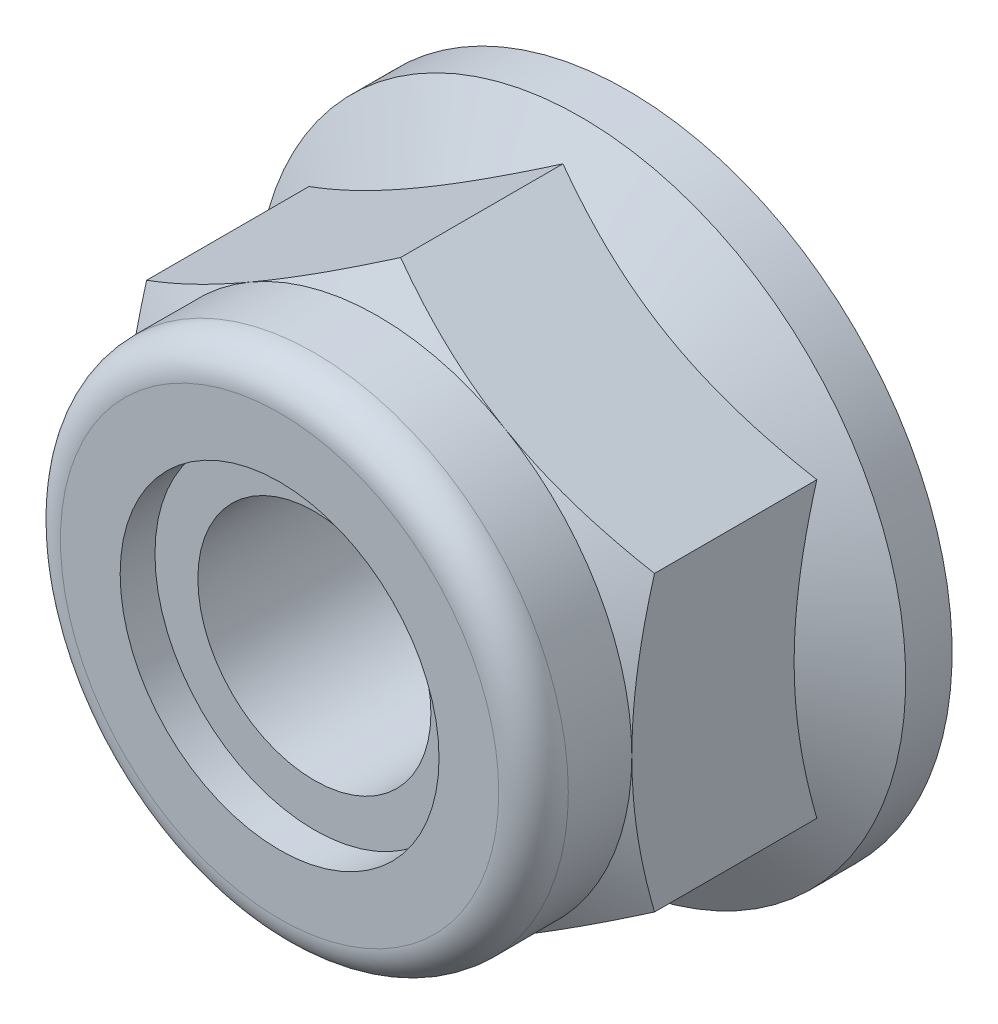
ISO-10303-21;
HEADER;
FILE_DESCRIPTION(('STEP AP214'),'2;1');
FILE_NAME('part.step','',(''),(''),'','','');
FILE_SCHEMA(('AUTOMOTIVE_DESIGN { 1 0 10303 214 1 1 1 1 }'));
ENDSEC;
DATA;
#1=APPLICATION_CONTEXT('core data for automotive mechanical design processes');
#2=APPLICATION_PROTOCOL_DEFINITION('international standard','automotive_design',2000,#1);
#3=PRODUCT_CONTEXT('',#1,'mechanical');
#4=PRODUCT('Part','Part','',(#3));
#5=PRODUCT_RELATED_PRODUCT_CATEGORY('part','',(#4));
#6=PRODUCT_DEFINITION_FORMATION('','',#4);
#7=PRODUCT_DEFINITION_CONTEXT('part definition',#1,'design');
#8=PRODUCT_DEFINITION('design','',#6,#7);
#9=PRODUCT_DEFINITION_SHAPE('','',#8);
#10=(LENGTH_UNIT() NAMED_UNIT(*) SI_UNIT(.MILLI.,.METRE.));
#11=(NAMED_UNIT(*) PLANE_ANGLE_UNIT() SI_UNIT($,.RADIAN.));
#12=(NAMED_UNIT(*) SI_UNIT($,.STERADIAN.) SOLID_ANGLE_UNIT());
#13=UNCERTAINTY_MEASURE_WITH_UNIT(LENGTH_MEASURE(1.E-05),#10,'distance_accuracy_value','');
#14=(GEOMETRIC_REPRESENTATION_CONTEXT(3) GLOBAL_UNCERTAINTY_ASSIGNED_CONTEXT((#13)) GLOBAL_UNIT_ASSIGNED_CONTEXT((#10,
#11,#12)) REPRESENTATION_CONTEXT('',''));
#15=CARTESIAN_POINT('',(0.,0.,0.));
#16=DIRECTION('',(0.,0.,1.));
#17=DIRECTION('',(1.,0.,0.));
#18=AXIS2_PLACEMENT_3D('',#15,#16,#17);
#19=CARTESIAN_POINT('',(0.,-6.42313721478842,22.4605702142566));
#20=DIRECTION('',(-0.5,0.866025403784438,0.));
#21=DIRECTION('',(-0.866025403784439,-0.5,0.));
#22=AXIS2_PLACEMENT_3D('',#19,#20,#21);
#23=PLANE('',#22);
#24=CARTESIAN_POINT('',(-0.000199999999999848,-6.42325268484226,4.96964844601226));
#25=CARTESIAN_POINT('',(0.122072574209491,-6.3526585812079,5.01040030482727));
#26=CARTESIAN_POINT('',(0.244801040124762,-6.28180126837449,5.04930273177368));
#27=CARTESIAN_POINT('',(0.491254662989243,-6.13951120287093,5.12289934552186));
#28=CARTESIAN_POINT('',(0.614980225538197,-6.06807821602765,5.15759171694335));
#29=CARTESIAN_POINT('',(0.988137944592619,-5.85263550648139,5.25467280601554));
#30=CARTESIAN_POINT('',(1.23904309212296,-5.70777535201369,5.30989166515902));
#31=CARTESIAN_POINT('',(1.61451808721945,-5.49099476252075,5.37464272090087));
#32=CARTESIAN_POINT('',(1.73796603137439,-5.41972205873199,5.39308850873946));
#33=CARTESIAN_POINT('',(1.98541973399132,-5.27685459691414,5.42401961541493));
#34=CARTESIAN_POINT('',(2.10942544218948,-5.20525986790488,5.43650546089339));
#35=CARTESIAN_POINT('',(2.35765224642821,-5.06194605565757,5.45519847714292));
#36=CARTESIAN_POINT('',(2.48187293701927,-4.9902272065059,5.46141277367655));
#37=CARTESIAN_POINT('',(2.73042222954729,-4.84672720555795,5.46743610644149));
#38=CARTESIAN_POINT('',(2.85475082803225,-4.7749460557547,5.46724534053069));
#39=CARTESIAN_POINT('',(3.19537539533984,-4.57828637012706,5.45791840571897));
#40=CARTESIAN_POINT('',(3.41155987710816,-4.4534722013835,5.44225911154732));
#41=CARTESIAN_POINT('',(3.84249295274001,-4.20467287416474,5.39260218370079));
#42=CARTESIAN_POINT('',(4.05724003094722,-4.08068859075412,5.35858757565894));
#43=CARTESIAN_POINT('',(4.4890404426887,-3.83138850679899,5.27356046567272));
#44=CARTESIAN_POINT('',(4.70603928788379,-3.70610416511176,5.22218769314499));
#45=CARTESIAN_POINT('',(5.13680081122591,-3.45740388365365,5.1055920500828));
#46=CARTESIAN_POINT('',(5.35056900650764,-3.33398475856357,5.04039656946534));
#47=CARTESIAN_POINT('',(5.5628,-3.21145313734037,4.96964844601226));
#48=B_SPLINE_CURVE_WITH_KNOTS('',3,(#24,#25,#26,#27,#28,#29,#30,#31,#32,#33,#34,#35,#36,#37,#38,
#39,#40,#41,#42,#43,#44,#45,#46,#47),.UNSPECIFIED.,.F.,.F.,(4,2,2,2,2,2,2,2,2,2,2,4),(0.,
0.440820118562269,0.881829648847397,1.76568130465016,2.19678242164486,2.62784543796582,
3.05841812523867,3.48897751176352,4.23854798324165,4.98881282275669,5.75571809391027,
6.52111769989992),.UNSPECIFIED.);
#49=CARTESIAN_POINT('',(0.,-6.42313721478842,4.96971511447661));
#50=VERTEX_POINT('',#49);
#51=CARTESIAN_POINT('',(2.78130000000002,-4.81735291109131,5.46654650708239));
#52=VERTEX_POINT('',#51);
#53=EDGE_CURVE('E294',#50,#52,#48,.T.);
#54=ORIENTED_EDGE('',*,*,#53,.F.);
#55=DIRECTION('',(0.,0.,-1.));
#56=VECTOR('',#55,1.);
#57=CARTESIAN_POINT('',(0.,-6.42313721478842,22.4605702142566));
#58=LINE('',#57,#56);
#59=CARTESIAN_POINT('',(0.,-6.42313721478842,1.41371511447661));
#60=VERTEX_POINT('',#59);
#61=EDGE_CURVE('E136',#50,#60,#58,.T.);
#62=ORIENTED_EDGE('',*,*,#61,.T.);
#63=CARTESIAN_POINT('',(-0.000199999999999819,-6.42325268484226,1.41364844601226));
#64=CARTESIAN_POINT('',(0.122072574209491,-6.3526585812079,1.45440030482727));
#65=CARTESIAN_POINT('',(0.244801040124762,-6.28180126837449,1.49330273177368));
#66=CARTESIAN_POINT('',(0.491254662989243,-6.13951120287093,1.56689934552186));
#67=CARTESIAN_POINT('',(0.614980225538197,-6.06807821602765,1.60159171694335));
#68=CARTESIAN_POINT('',(0.988137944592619,-5.85263550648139,1.69867280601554));
#69=CARTESIAN_POINT('',(1.23904309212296,-5.70777535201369,1.75389166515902));
#70=CARTESIAN_POINT('',(1.61451808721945,-5.49099476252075,1.81864272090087));
#71=CARTESIAN_POINT('',(1.73796603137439,-5.41972205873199,1.83708850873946));
#72=CARTESIAN_POINT('',(1.98541973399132,-5.27685459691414,1.86801961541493));
#73=CARTESIAN_POINT('',(2.10942544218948,-5.20525986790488,1.88050546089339));
#74=CARTESIAN_POINT('',(2.35765224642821,-5.06194605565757,1.89919847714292));
#75=CARTESIAN_POINT('',(2.48187293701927,-4.9902272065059,1.90541277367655));
#76=CARTESIAN_POINT('',(2.7304222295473,-4.84672720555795,1.91143610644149));
#77=CARTESIAN_POINT('',(2.85475082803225,-4.7749460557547,1.91124534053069));
#78=CARTESIAN_POINT('',(3.19537539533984,-4.57828637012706,1.90191840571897));
#79=CARTESIAN_POINT('',(3.41155987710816,-4.4534722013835,1.88625911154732));
#80=CARTESIAN_POINT('',(3.84249295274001,-4.20467287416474,1.83660218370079));
#81=CARTESIAN_POINT('',(4.05724003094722,-4.08068859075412,1.80258757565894));
#82=CARTESIAN_POINT('',(4.48904044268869,-3.83138850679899,1.71756046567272));
#83=CARTESIAN_POINT('',(4.70603928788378,-3.70610416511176,1.66618769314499));
#84=CARTESIAN_POINT('',(5.13680081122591,-3.45740388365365,1.5495920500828));
#85=CARTESIAN_POINT('',(5.35056900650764,-3.33398475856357,1.48439656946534));
#86=CARTESIAN_POINT('',(5.5628,-3.21145313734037,1.41364844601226));
#87=B_SPLINE_CURVE_WITH_KNOTS('',3,(#63,#64,#65,#66,#67,#68,#69,#70,#71,#72,#73,#74,#75,#76,#77,
#78,#79,#80,#81,#82,#83,#84,#85,#86),.UNSPECIFIED.,.F.,.F.,(4,2,2,2,2,2,2,2,2,2,2,4),(0.,
0.440820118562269,0.881829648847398,1.76568130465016,2.19678242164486,2.62784543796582,
3.05841812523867,3.48897751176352,4.23854798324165,4.98881282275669,5.75571809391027,
6.52111769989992),.UNSPECIFIED.);
#88=CARTESIAN_POINT('',(5.5626,-3.21156860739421,1.41371511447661));
#89=VERTEX_POINT('',#88);
#90=EDGE_CURVE('E264',#60,#89,#87,.T.);
#91=ORIENTED_EDGE('',*,*,#90,.T.);
#92=DIRECTION('',(0.,0.,-1.));
#93=VECTOR('',#92,1.);
#94=CARTESIAN_POINT('',(5.5626,-3.21156860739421,22.4605702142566));
#95=LINE('',#94,#93);
#96=CARTESIAN_POINT('',(5.5626,-3.21156860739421,4.96971511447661));
#97=VERTEX_POINT('',#96);
#98=EDGE_CURVE('E302',#97,#89,#95,.T.);
#99=ORIENTED_EDGE('',*,*,#98,.F.);
#100=EDGE_CURVE('E130',#52,#97,#48,.T.);
#101=ORIENTED_EDGE('',*,*,#100,.F.);
#102=EDGE_LOOP('',(#54,#62,#91,#99,#101));
#103=FACE_BOUND('',#102,.T.);
#104=ADVANCED_FACE('F50',(#103),#23,.F.);
#105=CARTESIAN_POINT('',(5.5626,-3.21156860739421,22.4605702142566));
#106=DIRECTION('',(-1.,0.,0.));
#107=DIRECTION('',(0.,0.,1.));
#108=AXIS2_PLACEMENT_3D('',#105,#106,#107);
#109=PLANE('',#108);
#110=CARTESIAN_POINT('',(5.5626,-8.51755323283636,2.80469385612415));
#111=CARTESIAN_POINT('',(5.5626,-8.27332363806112,2.92271908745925));
#112=CARTESIAN_POINT('',(5.5626,-8.02851660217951,3.0395710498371));
#113=CARTESIAN_POINT('',(5.5626,-7.53743543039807,3.27025799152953));
#114=CARTESIAN_POINT('',(5.5626,-7.29116104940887,3.38409244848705));
#115=CARTESIAN_POINT('',(5.5626,-6.79550261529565,3.60867362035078));
#116=CARTESIAN_POINT('',(5.5626,-6.54610883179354,3.71939893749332));
#117=CARTESIAN_POINT('',(5.5626,-6.04527145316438,3.93609364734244));
#118=CARTESIAN_POINT('',(5.5626,-5.79382796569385,4.04206328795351));
#119=CARTESIAN_POINT('',(5.5626,-5.28536985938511,4.24924012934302));
#120=CARTESIAN_POINT('',(5.5626,-5.02832474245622,4.35037289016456));
#121=CARTESIAN_POINT('',(5.5626,-4.51120244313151,4.54471766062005));
#122=CARTESIAN_POINT('',(5.5626,-4.25112492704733,4.63792878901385));
#123=CARTESIAN_POINT('',(5.5626,-3.72805915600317,4.81392599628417));
#124=CARTESIAN_POINT('',(5.5626,-3.46507843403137,4.89673423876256));
#125=CARTESIAN_POINT('',(5.5626,-2.9353756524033,5.04923536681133));
#126=CARTESIAN_POINT('',(5.5626,-2.66865480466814,5.11893239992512));
#127=CARTESIAN_POINT('',(5.5626,-2.13130244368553,5.24183109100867));
#128=CARTESIAN_POINT('',(5.5626,-1.86066990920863,5.29502835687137));
#129=CARTESIAN_POINT('',(5.5626,-1.31610403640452,5.38133241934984));
#130=CARTESIAN_POINT('',(5.5626,-1.04217069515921,5.41443919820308));
#131=CARTESIAN_POINT('',(5.5626,-0.63083475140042,5.44690919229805));
#132=CARTESIAN_POINT('',(5.5626,-0.494076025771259,5.45486914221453));
#133=CARTESIAN_POINT('',(5.5626,-0.220337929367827,5.46499403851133));
#134=CARTESIAN_POINT('',(5.5626,-0.0833585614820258,5.46715906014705));
#135=CARTESIAN_POINT('',(5.5626,0.190527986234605,5.46563594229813));
#136=CARTESIAN_POINT('',(5.5626,0.327435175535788,5.46194944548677));
#137=CARTESIAN_POINT('',(5.5626,0.600975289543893,5.44881671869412));
#138=CARTESIAN_POINT('',(5.5626,0.737608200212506,5.43937020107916));
#139=CARTESIAN_POINT('',(5.5626,1.06876418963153,5.40969085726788));
#140=CARTESIAN_POINT('',(5.5626,1.26303278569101,5.38657182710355));
#141=CARTESIAN_POINT('',(5.5626,1.6500813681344,5.32997193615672));
#142=CARTESIAN_POINT('',(5.5626,1.84286093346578,5.29648824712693));
#143=CARTESIAN_POINT('',(5.5626,2.22677234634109,5.22034654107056));
#144=CARTESIAN_POINT('',(5.5626,2.41790245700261,5.17767984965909));
#145=CARTESIAN_POINT('',(5.5626,2.7981962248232,5.08447396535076));
#146=CARTESIAN_POINT('',(5.5626,2.98736006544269,5.0339355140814));
#147=CARTESIAN_POINT('',(5.5626,3.36838035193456,4.92487411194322));
#148=CARTESIAN_POINT('',(5.5626,3.56018914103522,4.86618580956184));
#149=CARTESIAN_POINT('',(5.5626,3.94177929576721,4.74301046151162));
#150=CARTESIAN_POINT('',(5.5626,4.13156196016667,4.67852741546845));
#151=CARTESIAN_POINT('',(5.5626,4.5083383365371,4.54509454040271));
#152=CARTESIAN_POINT('',(5.5626,4.69534173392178,4.47617189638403));
#153=CARTESIAN_POINT('',(5.5626,5.06789764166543,4.33428124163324));
#154=CARTESIAN_POINT('',(5.5626,5.25344953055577,4.26131159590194));
#155=CARTESIAN_POINT('',(5.5626,5.43832732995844,4.18671878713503));
#156=B_SPLINE_CURVE_WITH_KNOTS('',3,(#110,#111,#112,#113,#114,#115,#116,#117,#118,#119,#120,
#121,#122,#123,#124,#125,#126,#127,#128,#129,#130,#131,#132,#133,#134,#135,#136,#137,#138,#139,
#140,#141,#142,#143,#144,#145,#146,#147,#148,#149,#150,#151,#152,#153,#154,#155),.UNSPECIFIED.,
.F.,.F.,(4,2,2,2,2,2,2,2,2,2,2,2,2,2,2,2,2,2,2,2,2,2,4),(0.,0.813769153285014,1.62767826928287,
2.44624505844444,3.26476912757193,4.09334213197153,4.92200719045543,5.74887568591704,
6.57548217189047,7.40230850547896,8.22913557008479,8.64000180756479,9.0508627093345,
9.46160829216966,9.87237438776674,10.4589658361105,11.0457174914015,11.633025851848,
12.2202789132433,12.8219268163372,13.4231625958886,14.021014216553,14.6191091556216),.UNSPECIFIED.);
#157=CARTESIAN_POINT('',(5.5626,0.,5.46654650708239));
#158=VERTEX_POINT('',#157);
#159=EDGE_CURVE('E122',#97,#158,#156,.T.);
#160=ORIENTED_EDGE('',*,*,#159,.F.);
#161=ORIENTED_EDGE('',*,*,#98,.T.);
#162=CARTESIAN_POINT('',(5.5626,-8.57284095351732,-0.778057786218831));
#163=CARTESIAN_POINT('',(5.5626,-8.33033463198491,-0.660637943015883));
#164=CARTESIAN_POINT('',(5.5626,-8.08726580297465,-0.544359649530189));
#165=CARTESIAN_POINT('',(5.5626,-7.59970378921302,-0.31472929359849));
#166=CARTESIAN_POINT('',(5.5626,-7.35521038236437,-0.201377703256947));
#167=CARTESIAN_POINT('',(5.5626,-6.86321410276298,0.0223379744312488));
#168=CARTESIAN_POINT('',(5.5626,-6.61570205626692,0.132681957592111));
#169=CARTESIAN_POINT('',(5.5626,-6.11869041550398,0.348781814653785));
#170=CARTESIAN_POINT('',(5.5626,-5.8691909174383,0.454537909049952));
#171=CARTESIAN_POINT('',(5.5626,-5.35995883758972,0.663469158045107));
#172=CARTESIAN_POINT('',(5.5626,-5.10015026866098,0.766460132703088));
#173=CARTESIAN_POINT('',(5.5626,-4.57747364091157,0.964516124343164));
#174=CARTESIAN_POINT('',(5.5626,-4.31460523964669,1.05958024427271));
#175=CARTESIAN_POINT('',(5.5626,-3.78590054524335,1.23924735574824));
#176=CARTESIAN_POINT('',(5.5626,-3.52007168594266,1.32387200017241));
#177=CARTESIAN_POINT('',(5.5626,-2.98460145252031,1.47990914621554));
#178=CARTESIAN_POINT('',(5.5626,-2.71496132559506,1.55132586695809));
#179=CARTESIAN_POINT('',(5.5626,-2.17320501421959,1.67710689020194));
#180=CARTESIAN_POINT('',(5.5626,-1.90111026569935,1.73156180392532));
#181=CARTESIAN_POINT('',(5.5626,-1.3535941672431,1.8203052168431));
#182=CARTESIAN_POINT('',(5.5626,-1.07817311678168,1.85459551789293));
#183=CARTESIAN_POINT('',(5.5626,-0.528954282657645,1.89982426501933));
#184=CARTESIAN_POINT('',(5.5626,-0.255181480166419,1.91105860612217));
#185=CARTESIAN_POINT('',(5.5626,0.292338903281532,1.90999858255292));
#186=CARTESIAN_POINT('',(5.5626,0.566086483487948,1.8977036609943));
#187=CARTESIAN_POINT('',(5.5626,1.03244886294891,1.85757660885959));
#188=CARTESIAN_POINT('',(5.5626,1.22556804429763,1.83528484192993));
#189=CARTESIAN_POINT('',(5.5626,1.61034862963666,1.78040863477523));
#190=CARTESIAN_POINT('',(5.5626,1.80200982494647,1.74782274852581));
#191=CARTESIAN_POINT('',(5.5626,2.37457656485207,1.63634135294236));
#192=CARTESIAN_POINT('',(5.5626,2.75284162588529,1.54374386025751));
#193=CARTESIAN_POINT('',(5.5626,3.3183672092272,1.38374284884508));
#194=CARTESIAN_POINT('',(5.5626,3.50857351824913,1.32616305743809));
#195=CARTESIAN_POINT('',(5.5626,3.8871375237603,1.20516419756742));
#196=CARTESIAN_POINT('',(5.5626,4.07549520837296,1.14174509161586));
#197=CARTESIAN_POINT('',(5.5626,4.45042430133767,1.01007349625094));
#198=CARTESIAN_POINT('',(5.5626,4.63699630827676,0.941822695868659));
#199=CARTESIAN_POINT('',(5.5626,5.00860424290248,0.801276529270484));
#200=CARTESIAN_POINT('',(5.5626,5.19364018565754,0.728981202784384));
#201=CARTESIAN_POINT('',(5.5626,5.6178263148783,0.558756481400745));
#202=CARTESIAN_POINT('',(5.5626,5.85650688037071,0.459659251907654));
#203=CARTESIAN_POINT('',(5.5626,6.33193644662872,0.256923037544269));
#204=CARTESIAN_POINT('',(5.5626,6.5686853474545,0.153283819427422));
#205=CARTESIAN_POINT('',(5.5626,7.04059162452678,-0.0576576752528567));
#206=CARTESIAN_POINT('',(5.5626,7.27574871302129,-0.164960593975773));
#207=CARTESIAN_POINT('',(5.5626,7.74469027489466,-0.38252918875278));
#208=CARTESIAN_POINT('',(5.5626,7.97847472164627,-0.492794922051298));
#209=CARTESIAN_POINT('',(5.5626,8.67851780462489,-0.827402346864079));
#210=CARTESIAN_POINT('',(5.5626,9.14304538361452,-1.05536370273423));
#211=CARTESIAN_POINT('',(5.5626,10.068793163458,-1.51790472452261));
#212=CARTESIAN_POINT('',(5.5626,10.530013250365,-1.75248461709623));
#213=CARTESIAN_POINT('',(5.5626,11.2017197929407,-2.09850330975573));
#214=CARTESIAN_POINT('',(5.5626,11.413174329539,-2.20806832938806));
#215=CARTESIAN_POINT('',(5.5626,11.8356219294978,-2.42807556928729));
#216=CARTESIAN_POINT('',(5.5626,12.0466150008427,-2.53851777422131));
#217=CARTESIAN_POINT('',(5.5626,12.6790097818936,-2.87099441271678));
#218=CARTESIAN_POINT('',(5.5626,13.0998112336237,-3.09417069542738));
#219=CARTESIAN_POINT('',(5.5626,13.9392069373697,-3.54234332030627));
#220=CARTESIAN_POINT('',(5.5626,14.3578040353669,-3.76733434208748));
#221=CARTESIAN_POINT('',(5.5626,15.1939759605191,-4.21915836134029));
#222=CARTESIAN_POINT('',(5.5626,15.6115508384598,-4.44599126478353));
#223=CARTESIAN_POINT('',(5.5626,16.0287456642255,-4.673516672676));
#224=B_SPLINE_CURVE_WITH_KNOTS('',3,(#162,#163,#164,#165,#166,#167,#168,#169,#170,#171,#172,
#173,#174,#175,#176,#177,#178,#179,#180,#181,#182,#183,#184,#185,#186,#187,#188,#189,#190,#191,
#192,#193,#194,#195,#196,#197,#198,#199,#200,#201,#202,#203,#204,#205,#206,#207,#208,#209,#210,
#211,#212,#213,#214,#215,#216,#217,#218,#219,#220,#221,#222,#223),.UNSPECIFIED.,.F.,.F.,(4,2,2,
2,2,2,2,2,2,2,2,2,2,2,2,2,2,2,2,2,2,2,2,2,2,2,2,2,2,2,4),(0.,0.808323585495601,1.61677675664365,
2.42972294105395,3.24263001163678,4.08096236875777,4.91938946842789,5.75604722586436,
6.59243725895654,7.42427940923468,8.25604721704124,9.07707180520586,9.89811582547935,
10.4810364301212,11.0640389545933,12.2307150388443,12.8268583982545,13.4230055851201,
14.0189453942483,14.6148793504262,15.390122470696,16.1654054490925,16.9408250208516,
17.7162595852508,19.268514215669,20.8208220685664,21.5352835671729,22.2497326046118,
23.6786841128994,25.1043723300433,26.5299882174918),.UNSPECIFIED.);
#225=CARTESIAN_POINT('',(5.5626,3.21156860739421,1.41371511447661));
#226=VERTEX_POINT('',#225);
#227=EDGE_CURVE('E257',#89,#226,#224,.T.);
#228=ORIENTED_EDGE('',*,*,#227,.T.);
#229=DIRECTION('',(0.,0.,-1.));
#230=VECTOR('',#229,1.);
#231=CARTESIAN_POINT('',(5.5626,3.21156860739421,22.4605702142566));
#232=LINE('',#231,#230);
#233=CARTESIAN_POINT('',(5.5626,3.21156860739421,4.96971511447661));
#234=VERTEX_POINT('',#233);
#235=EDGE_CURVE('E146',#234,#226,#232,.T.);
#236=ORIENTED_EDGE('',*,*,#235,.F.);
#237=EDGE_CURVE('E131',#158,#234,#156,.T.);
#238=ORIENTED_EDGE('',*,*,#237,.F.);
#239=EDGE_LOOP('',(#160,#161,#228,#236,#238));
#240=FACE_BOUND('',#239,.T.);
#241=ADVANCED_FACE('F148',(#240),#109,.F.);
#242=CARTESIAN_POINT('',(5.5626,3.21156860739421,22.4605702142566));
#243=DIRECTION('',(-0.5,-0.866025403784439,0.));
#244=DIRECTION('',(0.866025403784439,-0.5,0.));
#245=AXIS2_PLACEMENT_3D('',#242,#243,#244);
#246=PLANE('',#245);
#247=CARTESIAN_POINT('',(5.5628,3.21145313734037,4.96964844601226));
#248=CARTESIAN_POINT('',(5.44052742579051,3.28204724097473,5.01040030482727));
#249=CARTESIAN_POINT('',(5.31779895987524,3.35290455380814,5.04930273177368));
#250=CARTESIAN_POINT('',(5.07134533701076,3.49519461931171,5.12289934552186));
#251=CARTESIAN_POINT('',(4.9476197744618,3.56662760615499,5.15759171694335));
#252=CARTESIAN_POINT('',(4.57446205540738,3.78207031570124,5.25467280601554));
#253=CARTESIAN_POINT('',(4.32355690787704,3.92693047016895,5.30989166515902));
#254=CARTESIAN_POINT('',(3.94808191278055,4.14371105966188,5.37464272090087));
#255=CARTESIAN_POINT('',(3.82463396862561,4.21498376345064,5.39308850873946));
#256=CARTESIAN_POINT('',(3.57718026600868,4.35785122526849,5.42401961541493));
#257=CARTESIAN_POINT('',(3.45317455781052,4.42944595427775,5.43650546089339));
#258=CARTESIAN_POINT('',(3.20494775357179,4.57275976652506,5.45519847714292));
#259=CARTESIAN_POINT('',(3.08072706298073,4.64447861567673,5.46141277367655));
#260=CARTESIAN_POINT('',(2.8321777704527,4.78797861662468,5.46743610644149));
#261=CARTESIAN_POINT('',(2.70784917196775,4.85975976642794,5.46724534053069));
#262=CARTESIAN_POINT('',(2.36722460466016,5.05641945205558,5.45791840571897));
#263=CARTESIAN_POINT('',(2.15104012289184,5.18123362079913,5.44225911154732));
#264=CARTESIAN_POINT('',(1.72010704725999,5.4300329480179,5.39260218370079));
#265=CARTESIAN_POINT('',(1.50535996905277,5.55401723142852,5.35858757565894));
#266=CARTESIAN_POINT('',(1.0735595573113,5.80331731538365,5.27356046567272));
#267=CARTESIAN_POINT('',(0.856560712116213,5.92860165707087,5.22218769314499));
#268=CARTESIAN_POINT('',(0.425799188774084,6.17730193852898,5.1055920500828));
#269=CARTESIAN_POINT('',(0.212030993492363,6.30072106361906,5.04039656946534));
#270=CARTESIAN_POINT('',(-0.000200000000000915,6.42325268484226,4.96964844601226));
#271=B_SPLINE_CURVE_WITH_KNOTS('',3,(#247,#248,#249,#250,#251,#252,#253,#254,#255,#256,#257,
#258,#259,#260,#261,#262,#263,#264,#265,#266,#267,#268,#269,#270),.UNSPECIFIED.,.F.,.F.,(4,2,2,
2,2,2,2,2,2,2,2,4),(0.,0.440820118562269,0.881829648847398,1.76568130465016,2.19678242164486,
2.62784543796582,3.05841812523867,3.48897751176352,4.23854798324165,4.98881282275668,
5.75571809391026,6.52111769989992),.UNSPECIFIED.);
#272=CARTESIAN_POINT('',(2.78130000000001,4.81735291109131,5.46654650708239));
#273=VERTEX_POINT('',#272);
#274=EDGE_CURVE('E139',#234,#273,#271,.T.);
#275=ORIENTED_EDGE('',*,*,#274,.F.);
#276=ORIENTED_EDGE('',*,*,#235,.T.);
#277=CARTESIAN_POINT('',(5.5628,3.21145313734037,1.41364844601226));
#278=CARTESIAN_POINT('',(5.44052742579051,3.28204724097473,1.45440030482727));
#279=CARTESIAN_POINT('',(5.31779895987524,3.35290455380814,1.49330273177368));
#280=CARTESIAN_POINT('',(5.07134533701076,3.49519461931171,1.56689934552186));
#281=CARTESIAN_POINT('',(4.9476197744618,3.56662760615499,1.60159171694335));
#282=CARTESIAN_POINT('',(4.57446205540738,3.78207031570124,1.69867280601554));
#283=CARTESIAN_POINT('',(4.32355690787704,3.92693047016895,1.75389166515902));
#284=CARTESIAN_POINT('',(3.94808191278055,4.14371105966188,1.81864272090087));
#285=CARTESIAN_POINT('',(3.82463396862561,4.21498376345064,1.83708850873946));
#286=CARTESIAN_POINT('',(3.57718026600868,4.35785122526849,1.86801961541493));
#287=CARTESIAN_POINT('',(3.45317455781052,4.42944595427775,1.88050546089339));
#288=CARTESIAN_POINT('',(3.20494775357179,4.57275976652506,1.89919847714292));
#289=CARTESIAN_POINT('',(3.08072706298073,4.64447861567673,1.90541277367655));
#290=CARTESIAN_POINT('',(2.8321777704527,4.78797861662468,1.91143610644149));
#291=CARTESIAN_POINT('',(2.70784917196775,4.85975976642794,1.91124534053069));
#292=CARTESIAN_POINT('',(2.36722460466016,5.05641945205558,1.90191840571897));
#293=CARTESIAN_POINT('',(2.15104012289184,5.18123362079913,1.88625911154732));
#294=CARTESIAN_POINT('',(1.72010704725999,5.4300329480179,1.83660218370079));
#295=CARTESIAN_POINT('',(1.50535996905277,5.55401723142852,1.80258757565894));
#296=CARTESIAN_POINT('',(1.0735595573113,5.80331731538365,1.71756046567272));
#297=CARTESIAN_POINT('',(0.856560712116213,5.92860165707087,1.66618769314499));
#298=CARTESIAN_POINT('',(0.425799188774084,6.17730193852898,1.5495920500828));
#299=CARTESIAN_POINT('',(0.212030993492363,6.30072106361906,1.48439656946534));
#300=CARTESIAN_POINT('',(-0.000200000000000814,6.42325268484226,1.41364844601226));
#301=B_SPLINE_CURVE_WITH_KNOTS('',3,(#277,#278,#279,#280,#281,#282,#283,#284,#285,#286,#287,
#288,#289,#290,#291,#292,#293,#294,#295,#296,#297,#298,#299,#300),.UNSPECIFIED.,.F.,.F.,(4,2,2,
2,2,2,2,2,2,2,2,4),(0.,0.440820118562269,0.881829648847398,1.76568130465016,2.19678242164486,
2.62784543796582,3.05841812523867,3.48897751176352,4.23854798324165,4.98881282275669,
5.75571809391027,6.52111769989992),.UNSPECIFIED.);
#302=CARTESIAN_POINT('',(0.,6.42313721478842,1.41371511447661));
#303=VERTEX_POINT('',#302);
#304=EDGE_CURVE('E226',#226,#303,#301,.T.);
#305=ORIENTED_EDGE('',*,*,#304,.T.);
#306=DIRECTION('',(0.,0.,-1.));
#307=VECTOR('',#306,1.);
#308=CARTESIAN_POINT('',(0.,6.42313721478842,22.4605702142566));
#309=LINE('',#308,#307);
#310=CARTESIAN_POINT('',(0.,6.42313721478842,4.96971511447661));
#311=VERTEX_POINT('',#310);
#312=EDGE_CURVE('E311',#311,#303,#309,.T.);
#313=ORIENTED_EDGE('',*,*,#312,.F.);
#314=EDGE_CURVE('E149',#273,#311,#271,.T.);
#315=ORIENTED_EDGE('',*,*,#314,.F.);
#316=EDGE_LOOP('',(#275,#276,#305,#313,#315));
#317=FACE_BOUND('',#316,.T.);
#318=ADVANCED_FACE('F211',(#317),#246,.F.);
#319=CARTESIAN_POINT('',(0.,6.42313721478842,22.4605702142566));
#320=DIRECTION('',(0.5,-0.866025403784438,0.));
#321=DIRECTION('',(0.866025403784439,0.5,0.));
#322=AXIS2_PLACEMENT_3D('',#319,#320,#321);
#323=PLANE('',#322);
#324=CARTESIAN_POINT('',(0.000199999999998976,6.42325268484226,4.96964844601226));
#325=CARTESIAN_POINT('',(-0.122072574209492,6.3526585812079,5.01040030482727));
#326=CARTESIAN_POINT('',(-0.244801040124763,6.28180126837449,5.04930273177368));
#327=CARTESIAN_POINT('',(-0.491254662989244,6.13951120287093,5.12289934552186));
#328=CARTESIAN_POINT('',(-0.614980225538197,6.06807821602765,5.15759171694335));
#329=CARTESIAN_POINT('',(-0.988137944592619,5.85263550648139,5.25467280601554));
#330=CARTESIAN_POINT('',(-1.23904309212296,5.70777535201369,5.30989166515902));
#331=CARTESIAN_POINT('',(-1.61451808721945,5.49099476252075,5.37464272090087));
#332=CARTESIAN_POINT('',(-1.73796603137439,5.41972205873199,5.39308850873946));
#333=CARTESIAN_POINT('',(-1.98541973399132,5.27685459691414,5.42401961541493));
#334=CARTESIAN_POINT('',(-2.10942544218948,5.20525986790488,5.43650546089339));
#335=CARTESIAN_POINT('',(-2.35765224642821,5.06194605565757,5.45519847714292));
#336=CARTESIAN_POINT('',(-2.48187293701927,4.9902272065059,5.46141277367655));
#337=CARTESIAN_POINT('',(-2.7304222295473,4.84672720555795,5.46743610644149));
#338=CARTESIAN_POINT('',(-2.85475082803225,4.7749460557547,5.46724534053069));
#339=CARTESIAN_POINT('',(-3.19537539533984,4.57828637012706,5.45791840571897));
#340=CARTESIAN_POINT('',(-3.41155987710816,4.4534722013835,5.44225911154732));
#341=CARTESIAN_POINT('',(-3.84249295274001,4.20467287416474,5.39260218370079));
#342=CARTESIAN_POINT('',(-4.05724003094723,4.08068859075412,5.35858757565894));
#343=CARTESIAN_POINT('',(-4.4890404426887,3.83138850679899,5.27356046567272));
#344=CARTESIAN_POINT('',(-4.70603928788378,3.70610416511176,5.22218769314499));
#345=CARTESIAN_POINT('',(-5.13680081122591,3.45740388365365,5.1055920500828));
#346=CARTESIAN_POINT('',(-5.35056900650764,3.33398475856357,5.04039656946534));
#347=CARTESIAN_POINT('',(-5.5628,3.21145313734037,4.96964844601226));
#348=B_SPLINE_CURVE_WITH_KNOTS('',3,(#324,#325,#326,#327,#328,#329,#330,#331,#332,#333,#334,
#335,#336,#337,#338,#339,#340,#341,#342,#343,#344,#345,#346,#347),.UNSPECIFIED.,.F.,.F.,(4,2,2,
2,2,2,2,2,2,2,2,4),(0.,0.440820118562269,0.881829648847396,1.76568130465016,2.19678242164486,
2.62784543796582,3.05841812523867,3.48897751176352,4.23854798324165,4.98881282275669,
5.75571809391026,6.52111769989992),.UNSPECIFIED.);
#349=CARTESIAN_POINT('',(-2.78129999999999,4.81735291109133,5.46654650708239));
#350=VERTEX_POINT('',#349);
#351=EDGE_CURVE('E210',#311,#350,#348,.T.);
#352=ORIENTED_EDGE('',*,*,#351,.F.);
#353=ORIENTED_EDGE('',*,*,#312,.T.);
#354=CARTESIAN_POINT('',(0.000199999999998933,6.42325268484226,1.41364844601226));
#355=CARTESIAN_POINT('',(-0.122072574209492,6.3526585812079,1.45440030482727));
#356=CARTESIAN_POINT('',(-0.244801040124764,6.28180126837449,1.49330273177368));
#357=CARTESIAN_POINT('',(-0.491254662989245,6.13951120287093,1.56689934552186));
#358=CARTESIAN_POINT('',(-0.614980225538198,6.06807821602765,1.60159171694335));
#359=CARTESIAN_POINT('',(-0.988137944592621,5.85263550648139,1.69867280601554));
#360=CARTESIAN_POINT('',(-1.23904309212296,5.70777535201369,1.75389166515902));
#361=CARTESIAN_POINT('',(-1.61451808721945,5.49099476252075,1.81864272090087));
#362=CARTESIAN_POINT('',(-1.73796603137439,5.41972205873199,1.83708850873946));
#363=CARTESIAN_POINT('',(-1.98541973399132,5.27685459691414,1.86801961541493));
#364=CARTESIAN_POINT('',(-2.10942544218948,5.20525986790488,1.88050546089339));
#365=CARTESIAN_POINT('',(-2.35765224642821,5.06194605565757,1.89919847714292));
#366=CARTESIAN_POINT('',(-2.48187293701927,4.9902272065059,1.90541277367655));
#367=CARTESIAN_POINT('',(-2.7304222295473,4.84672720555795,1.91143610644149));
#368=CARTESIAN_POINT('',(-2.85475082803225,4.7749460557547,1.91124534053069));
#369=CARTESIAN_POINT('',(-3.19537539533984,4.57828637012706,1.90191840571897));
#370=CARTESIAN_POINT('',(-3.41155987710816,4.4534722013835,1.88625911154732));
#371=CARTESIAN_POINT('',(-3.84249295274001,4.20467287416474,1.83660218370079));
#372=CARTESIAN_POINT('',(-4.05724003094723,4.08068859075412,1.80258757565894));
#373=CARTESIAN_POINT('',(-4.4890404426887,3.83138850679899,1.71756046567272));
#374=CARTESIAN_POINT('',(-4.70603928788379,3.70610416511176,1.66618769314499));
#375=CARTESIAN_POINT('',(-5.13680081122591,3.45740388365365,1.5495920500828));
#376=CARTESIAN_POINT('',(-5.35056900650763,3.33398475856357,1.48439656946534));
#377=CARTESIAN_POINT('',(-5.5628,3.21145313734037,1.41364844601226));
#378=B_SPLINE_CURVE_WITH_KNOTS('',3,(#354,#355,#356,#357,#358,#359,#360,#361,#362,#363,#364,
#365,#366,#367,#368,#369,#370,#371,#372,#373,#374,#375,#376,#377),.UNSPECIFIED.,.F.,.F.,(4,2,2,
2,2,2,2,2,2,2,2,4),(0.,0.44082011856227,0.881829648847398,1.76568130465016,2.19678242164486,
2.62784543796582,3.05841812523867,3.48897751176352,4.23854798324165,4.98881282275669,
5.75571809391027,6.52111769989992),.UNSPECIFIED.);
#379=CARTESIAN_POINT('',(-5.5626,3.21156860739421,1.41371511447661));
#380=VERTEX_POINT('',#379);
#381=EDGE_CURVE('E217',#303,#380,#378,.T.);
#382=ORIENTED_EDGE('',*,*,#381,.T.);
#383=DIRECTION('',(0.,0.,-1.));
#384=VECTOR('',#383,1.);
#385=CARTESIAN_POINT('',(-5.5626,3.21156860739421,22.4605702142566));
#386=LINE('',#385,#384);
#387=CARTESIAN_POINT('',(-5.5626,3.21156860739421,4.96971511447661));
#388=VERTEX_POINT('',#387);
#389=EDGE_CURVE('E307',#388,#380,#386,.T.);
#390=ORIENTED_EDGE('',*,*,#389,.F.);
#391=EDGE_CURVE('E203',#350,#388,#348,.T.);
#392=ORIENTED_EDGE('',*,*,#391,.F.);
#393=EDGE_LOOP('',(#352,#353,#382,#390,#392));
#394=FACE_BOUND('',#393,.T.);
#395=ADVANCED_FACE('F209',(#394),#323,.F.);
#396=CARTESIAN_POINT('',(-5.5626,3.21156860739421,22.4605702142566));
#397=DIRECTION('',(1.,0.,0.));
#398=DIRECTION('',(0.,1.,0.));
#399=AXIS2_PLACEMENT_3D('',#396,#397,#398);
#400=PLANE('',#399);
#401=CARTESIAN_POINT('',(-5.5626,-8.51755323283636,2.80469385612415));
#402=CARTESIAN_POINT('',(-5.5626,-8.27332363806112,2.92271908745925));
#403=CARTESIAN_POINT('',(-5.5626,-8.02851660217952,3.0395710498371));
#404=CARTESIAN_POINT('',(-5.5626,-7.53743543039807,3.27025799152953));
#405=CARTESIAN_POINT('',(-5.5626,-7.29116104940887,3.38409244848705));
#406=CARTESIAN_POINT('',(-5.5626,-6.79550261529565,3.60867362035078));
#407=CARTESIAN_POINT('',(-5.5626,-6.54610883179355,3.71939893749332));
#408=CARTESIAN_POINT('',(-5.5626,-6.04527145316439,3.93609364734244));
#409=CARTESIAN_POINT('',(-5.5626,-5.79382796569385,4.04206328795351));
#410=CARTESIAN_POINT('',(-5.5626,-5.28536985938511,4.24924012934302));
#411=CARTESIAN_POINT('',(-5.5626,-5.02832474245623,4.35037289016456));
#412=CARTESIAN_POINT('',(-5.5626,-4.51120244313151,4.54471766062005));
#413=CARTESIAN_POINT('',(-5.5626,-4.25112492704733,4.63792878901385));
#414=CARTESIAN_POINT('',(-5.5626,-3.72805915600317,4.81392599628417));
#415=CARTESIAN_POINT('',(-5.5626,-3.46507843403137,4.89673423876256));
#416=CARTESIAN_POINT('',(-5.5626,-2.93537565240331,5.04923536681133));
#417=CARTESIAN_POINT('',(-5.5626,-2.66865480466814,5.11893239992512));
#418=CARTESIAN_POINT('',(-5.5626,-2.13130244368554,5.24183109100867));
#419=CARTESIAN_POINT('',(-5.5626,-1.86066990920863,5.29502835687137));
#420=CARTESIAN_POINT('',(-5.5626,-1.31610403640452,5.38133241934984));
#421=CARTESIAN_POINT('',(-5.5626,-1.04217069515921,5.41443919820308));
#422=CARTESIAN_POINT('',(-5.5626,-0.630834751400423,5.44690919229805));
#423=CARTESIAN_POINT('',(-5.5626,-0.494076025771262,5.45486914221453));
#424=CARTESIAN_POINT('',(-5.5626,-0.22033792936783,5.46499403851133));
#425=CARTESIAN_POINT('',(-5.5626,-0.0833585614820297,5.46715906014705));
#426=CARTESIAN_POINT('',(-5.5626,0.190527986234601,5.46563594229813));
#427=CARTESIAN_POINT('',(-5.5626,0.327435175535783,5.46194944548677));
#428=CARTESIAN_POINT('',(-5.5626,0.600975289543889,5.44881671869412));
#429=CARTESIAN_POINT('',(-5.5626,0.737608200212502,5.43937020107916));
#430=CARTESIAN_POINT('',(-5.5626,1.06876418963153,5.40969085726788));
#431=CARTESIAN_POINT('',(-5.5626,1.263032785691,5.38657182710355));
#432=CARTESIAN_POINT('',(-5.5626,1.6500813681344,5.32997193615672));
#433=CARTESIAN_POINT('',(-5.5626,1.84286093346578,5.29648824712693));
#434=CARTESIAN_POINT('',(-5.5626,2.22677234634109,5.22034654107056));
#435=CARTESIAN_POINT('',(-5.5626,2.41790245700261,5.17767984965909));
#436=CARTESIAN_POINT('',(-5.5626,2.79819622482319,5.08447396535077));
#437=CARTESIAN_POINT('',(-5.5626,2.98736006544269,5.0339355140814));
#438=CARTESIAN_POINT('',(-5.5626,3.36838035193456,4.92487411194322));
#439=CARTESIAN_POINT('',(-5.5626,3.56018914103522,4.86618580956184));
#440=CARTESIAN_POINT('',(-5.5626,3.9417792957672,4.74301046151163));
#441=CARTESIAN_POINT('',(-5.5626,4.13156196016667,4.67852741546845));
#442=CARTESIAN_POINT('',(-5.5626,4.50833833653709,4.54509454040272));
#443=CARTESIAN_POINT('',(-5.5626,4.69534173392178,4.47617189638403));
#444=CARTESIAN_POINT('',(-5.5626,5.06789764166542,4.33428124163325));
#445=CARTESIAN_POINT('',(-5.5626,5.25344953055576,4.26131159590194));
#446=CARTESIAN_POINT('',(-5.5626,5.43832732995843,4.18671878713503));
#447=B_SPLINE_CURVE_WITH_KNOTS('',3,(#401,#402,#403,#404,#405,#406,#407,#408,#409,#410,#411,
#412,#413,#414,#415,#416,#417,#418,#419,#420,#421,#422,#423,#424,#425,#426,#427,#428,#429,#430,
#431,#432,#433,#434,#435,#436,#437,#438,#439,#440,#441,#442,#443,#444,#445,#446),.UNSPECIFIED.,
.F.,.F.,(4,2,2,2,2,2,2,2,2,2,2,2,2,2,2,2,2,2,2,2,2,2,4),(0.,0.813769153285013,1.62767826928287,
2.44624505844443,3.26476912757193,4.09334213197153,4.92200719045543,5.74887568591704,
6.57548217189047,7.40230850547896,8.22913557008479,8.64000180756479,9.0508627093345,
9.46160829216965,9.87237438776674,10.4589658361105,11.0457174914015,11.633025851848,
12.2202789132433,12.8219268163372,13.4231625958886,14.021014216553,14.6191091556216),.UNSPECIFIED.);
#448=CARTESIAN_POINT('',(-5.5626,0.,5.46654650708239));
#449=VERTEX_POINT('',#448);
#450=EDGE_CURVE('E206',#388,#449,#447,.F.);
#451=ORIENTED_EDGE('',*,*,#450,.F.);
#452=ORIENTED_EDGE('',*,*,#389,.T.);
#453=CARTESIAN_POINT('',(-5.5626,-8.57284095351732,-0.778057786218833));
#454=CARTESIAN_POINT('',(-5.5626,-8.33033463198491,-0.660637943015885));
#455=CARTESIAN_POINT('',(-5.5626,-8.08726580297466,-0.544359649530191));
#456=CARTESIAN_POINT('',(-5.5626,-7.59970378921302,-0.314729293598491));
#457=CARTESIAN_POINT('',(-5.5626,-7.35521038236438,-0.201377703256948));
#458=CARTESIAN_POINT('',(-5.5626,-6.86321410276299,0.0223379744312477));
#459=CARTESIAN_POINT('',(-5.5626,-6.61570205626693,0.132681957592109));
#460=CARTESIAN_POINT('',(-5.5626,-6.11869041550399,0.348781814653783));
#461=CARTESIAN_POINT('',(-5.5626,-5.86919091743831,0.45453790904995));
#462=CARTESIAN_POINT('',(-5.5626,-5.35995883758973,0.663469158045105));
#463=CARTESIAN_POINT('',(-5.5626,-5.10015026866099,0.766460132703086));
#464=CARTESIAN_POINT('',(-5.5626,-4.57747364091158,0.964516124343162));
#465=CARTESIAN_POINT('',(-5.5626,-4.3146052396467,1.05958024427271));
#466=CARTESIAN_POINT('',(-5.5626,-3.78590054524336,1.23924735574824));
#467=CARTESIAN_POINT('',(-5.5626,-3.52007168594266,1.32387200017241));
#468=CARTESIAN_POINT('',(-5.5626,-2.98460145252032,1.47990914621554));
#469=CARTESIAN_POINT('',(-5.5626,-2.71496132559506,1.55132586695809));
#470=CARTESIAN_POINT('',(-5.5626,-2.17320501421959,1.67710689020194));
#471=CARTESIAN_POINT('',(-5.5626,-1.90111026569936,1.73156180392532));
#472=CARTESIAN_POINT('',(-5.5626,-1.35359416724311,1.8203052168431));
#473=CARTESIAN_POINT('',(-5.5626,-1.07817311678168,1.85459551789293));
#474=CARTESIAN_POINT('',(-5.5626,-0.528954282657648,1.89982426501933));
#475=CARTESIAN_POINT('',(-5.5626,-0.255181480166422,1.91105860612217));
#476=CARTESIAN_POINT('',(-5.5626,0.292338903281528,1.90999858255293));
#477=CARTESIAN_POINT('',(-5.5626,0.566086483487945,1.8977036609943));
#478=CARTESIAN_POINT('',(-5.5626,1.03244886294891,1.85757660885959));
#479=CARTESIAN_POINT('',(-5.5626,1.22556804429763,1.83528484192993));
#480=CARTESIAN_POINT('',(-5.5626,1.61034862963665,1.78040863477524));
#481=CARTESIAN_POINT('',(-5.5626,1.80200982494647,1.74782274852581));
#482=CARTESIAN_POINT('',(-5.5626,2.37457656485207,1.63634135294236));
#483=CARTESIAN_POINT('',(-5.5626,2.75284162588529,1.54374386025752));
#484=CARTESIAN_POINT('',(-5.5626,3.3183672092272,1.38374284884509));
#485=CARTESIAN_POINT('',(-5.5626,3.50857351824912,1.32616305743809));
#486=CARTESIAN_POINT('',(-5.5626,3.8871375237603,1.20516419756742));
#487=CARTESIAN_POINT('',(-5.5626,4.07549520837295,1.14174509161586));
#488=CARTESIAN_POINT('',(-5.5626,4.45042430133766,1.01007349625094));
#489=CARTESIAN_POINT('',(-5.5626,4.63699630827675,0.941822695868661));
#490=CARTESIAN_POINT('',(-5.5626,5.00860424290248,0.801276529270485));
#491=CARTESIAN_POINT('',(-5.5626,5.19364018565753,0.728981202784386));
#492=CARTESIAN_POINT('',(-5.5626,5.61782631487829,0.558756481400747));
#493=CARTESIAN_POINT('',(-5.5626,5.8565068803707,0.459659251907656));
#494=CARTESIAN_POINT('',(-5.5626,6.33193644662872,0.256923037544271));
#495=CARTESIAN_POINT('',(-5.5626,6.56868534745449,0.153283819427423));
#496=CARTESIAN_POINT('',(-5.5626,7.04059162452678,-0.0576576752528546));
#497=CARTESIAN_POINT('',(-5.5626,7.27574871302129,-0.16496059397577));
#498=CARTESIAN_POINT('',(-5.5626,7.74469027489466,-0.382529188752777));
#499=CARTESIAN_POINT('',(-5.5626,7.97847472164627,-0.492794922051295));
#500=CARTESIAN_POINT('',(-5.5626,8.67851780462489,-0.827402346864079));
#501=CARTESIAN_POINT('',(-5.5626,9.14304538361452,-1.05536370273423));
#502=CARTESIAN_POINT('',(-5.5626,10.068793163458,-1.51790472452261));
#503=CARTESIAN_POINT('',(-5.5626,10.530013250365,-1.75248461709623));
#504=CARTESIAN_POINT('',(-5.5626,11.2017197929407,-2.09850330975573));
#505=CARTESIAN_POINT('',(-5.5626,11.413174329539,-2.20806832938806));
#506=CARTESIAN_POINT('',(-5.5626,11.8356219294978,-2.42807556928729));
#507=CARTESIAN_POINT('',(-5.5626,12.0466150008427,-2.53851777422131));
#508=CARTESIAN_POINT('',(-5.5626,12.6790097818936,-2.87099441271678));
#509=CARTESIAN_POINT('',(-5.5626,13.0998112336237,-3.09417069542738));
#510=CARTESIAN_POINT('',(-5.5626,13.9392069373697,-3.54234332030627));
#511=CARTESIAN_POINT('',(-5.5626,14.3578040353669,-3.76733434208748));
#512=CARTESIAN_POINT('',(-5.5626,15.1939759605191,-4.21915836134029));
#513=CARTESIAN_POINT('',(-5.5626,15.6115508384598,-4.44599126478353));
#514=CARTESIAN_POINT('',(-5.5626,16.0287456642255,-4.673516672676));
#515=B_SPLINE_CURVE_WITH_KNOTS('',3,(#453,#454,#455,#456,#457,#458,#459,#460,#461,#462,#463,
#464,#465,#466,#467,#468,#469,#470,#471,#472,#473,#474,#475,#476,#477,#478,#479,#480,#481,#482,
#483,#484,#485,#486,#487,#488,#489,#490,#491,#492,#493,#494,#495,#496,#497,#498,#499,#500,#501,
#502,#503,#504,#505,#506,#507,#508,#509,#510,#511,#512,#513,#514),.UNSPECIFIED.,.F.,.F.,(4,2,2,
2,2,2,2,2,2,2,2,2,2,2,2,2,2,2,2,2,2,2,2,2,2,2,2,2,2,2,4),(0.,0.808323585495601,1.61677675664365,
2.42972294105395,3.24263001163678,4.08096236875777,4.91938946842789,5.75604722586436,
6.59243725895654,7.42427940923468,8.25604721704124,9.07707180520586,9.89811582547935,
10.4810364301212,11.0640389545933,12.2307150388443,12.8268583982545,13.4230055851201,
14.0189453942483,14.6148793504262,15.390122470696,16.1654054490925,16.9408250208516,
17.7162595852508,19.268514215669,20.8208220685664,21.535283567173,22.2497326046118,
23.6786841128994,25.1043723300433,26.5299882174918),.UNSPECIFIED.);
#516=CARTESIAN_POINT('',(-5.5626,-3.21156860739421,1.41371511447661));
#517=VERTEX_POINT('',#516);
#518=EDGE_CURVE('E230',#380,#517,#515,.F.);
#519=ORIENTED_EDGE('',*,*,#518,.T.);
#520=DIRECTION('',(0.,0.,-1.));
#521=VECTOR('',#520,1.);
#522=CARTESIAN_POINT('',(-5.5626,-3.21156860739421,22.4605702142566));
#523=LINE('',#522,#521);
#524=CARTESIAN_POINT('',(-5.5626,-3.21156860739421,4.96971511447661));
#525=VERTEX_POINT('',#524);
#526=EDGE_CURVE('E310',#525,#517,#523,.T.);
#527=ORIENTED_EDGE('',*,*,#526,.F.);
#528=EDGE_CURVE('E194',#449,#525,#447,.F.);
#529=ORIENTED_EDGE('',*,*,#528,.F.);
#530=EDGE_LOOP('',(#451,#452,#519,#527,#529));
#531=FACE_BOUND('',#530,.T.);
#532=ADVANCED_FACE('F215',(#531),#400,.F.);
#533=CARTESIAN_POINT('',(-5.5626,-3.21156860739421,22.4605702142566));
#534=DIRECTION('',(0.5,0.866025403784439,0.));
#535=DIRECTION('',(-0.866025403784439,0.5,0.));
#536=AXIS2_PLACEMENT_3D('',#533,#534,#535);
#537=PLANE('',#536);
#538=CARTESIAN_POINT('',(-5.5628,-3.21145313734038,4.96964844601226));
#539=CARTESIAN_POINT('',(-5.44052742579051,-3.28204724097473,5.01040030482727));
#540=CARTESIAN_POINT('',(-5.31779895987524,-3.35290455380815,5.04930273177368));
#541=CARTESIAN_POINT('',(-5.07134533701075,-3.49519461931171,5.12289934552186));
#542=CARTESIAN_POINT('',(-4.9476197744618,-3.56662760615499,5.15759171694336));
#543=CARTESIAN_POINT('',(-4.57446205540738,-3.78207031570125,5.25467280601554));
#544=CARTESIAN_POINT('',(-4.32355690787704,-3.92693047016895,5.30989166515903));
#545=CARTESIAN_POINT('',(-3.94808191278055,-4.14371105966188,5.37464272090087));
#546=CARTESIAN_POINT('',(-3.82463396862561,-4.21498376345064,5.39308850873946));
#547=CARTESIAN_POINT('',(-3.57718026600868,-4.35785122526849,5.42401961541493));
#548=CARTESIAN_POINT('',(-3.45317455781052,-4.42944595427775,5.43650546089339));
#549=CARTESIAN_POINT('',(-3.20494775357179,-4.57275976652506,5.45519847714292));
#550=CARTESIAN_POINT('',(-3.08072706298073,-4.64447861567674,5.46141277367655));
#551=CARTESIAN_POINT('',(-2.8321777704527,-4.78797861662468,5.46743610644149));
#552=CARTESIAN_POINT('',(-2.70784917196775,-4.85975976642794,5.46724534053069));
#553=CARTESIAN_POINT('',(-2.36722460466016,-5.05641945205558,5.45791840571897));
#554=CARTESIAN_POINT('',(-2.15104012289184,-5.18123362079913,5.44225911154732));
#555=CARTESIAN_POINT('',(-1.72010704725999,-5.4300329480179,5.39260218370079));
#556=CARTESIAN_POINT('',(-1.50535996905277,-5.55401723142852,5.35858757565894));
#557=CARTESIAN_POINT('',(-1.0735595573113,-5.80331731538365,5.27356046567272));
#558=CARTESIAN_POINT('',(-0.856560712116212,-5.92860165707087,5.22218769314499));
#559=CARTESIAN_POINT('',(-0.425799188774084,-6.17730193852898,5.1055920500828));
#560=CARTESIAN_POINT('',(-0.212030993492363,-6.30072106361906,5.04039656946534));
#561=CARTESIAN_POINT('',(0.000200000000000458,-6.42325268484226,4.96964844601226));
#562=B_SPLINE_CURVE_WITH_KNOTS('',3,(#538,#539,#540,#541,#542,#543,#544,#545,#546,#547,#548,
#549,#550,#551,#552,#553,#554,#555,#556,#557,#558,#559,#560,#561),.UNSPECIFIED.,.F.,.F.,(4,2,2,
2,2,2,2,2,2,2,2,4),(0.,0.440820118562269,0.881829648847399,1.76568130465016,2.19678242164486,
2.62784543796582,3.05841812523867,3.48897751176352,4.23854798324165,4.98881282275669,
5.75571809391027,6.52111769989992),.UNSPECIFIED.);
#563=CARTESIAN_POINT('',(-2.78129999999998,-4.81735291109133,5.46654650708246));
#564=VERTEX_POINT('',#563);
#565=EDGE_CURVE('E373',#525,#564,#562,.T.);
#566=ORIENTED_EDGE('',*,*,#565,.F.);
#567=ORIENTED_EDGE('',*,*,#526,.T.);
#568=CARTESIAN_POINT('',(-5.5628,-3.21145313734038,1.41364844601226));
#569=CARTESIAN_POINT('',(-5.44052742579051,-3.28204724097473,1.45440030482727));
#570=CARTESIAN_POINT('',(-5.31779895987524,-3.35290455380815,1.49330273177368));
#571=CARTESIAN_POINT('',(-5.07134533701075,-3.49519461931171,1.56689934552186));
#572=CARTESIAN_POINT('',(-4.9476197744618,-3.56662760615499,1.60159171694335));
#573=CARTESIAN_POINT('',(-4.57446205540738,-3.78207031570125,1.69867280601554));
#574=CARTESIAN_POINT('',(-4.32355690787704,-3.92693047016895,1.75389166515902));
#575=CARTESIAN_POINT('',(-3.94808191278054,-4.14371105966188,1.81864272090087));
#576=CARTESIAN_POINT('',(-3.8246339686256,-4.21498376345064,1.83708850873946));
#577=CARTESIAN_POINT('',(-3.57718026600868,-4.35785122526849,1.86801961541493));
#578=CARTESIAN_POINT('',(-3.45317455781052,-4.42944595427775,1.88050546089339));
#579=CARTESIAN_POINT('',(-3.20494775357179,-4.57275976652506,1.89919847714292));
#580=CARTESIAN_POINT('',(-3.08072706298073,-4.64447861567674,1.90541277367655));
#581=CARTESIAN_POINT('',(-2.8321777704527,-4.78797861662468,1.91143610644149));
#582=CARTESIAN_POINT('',(-2.70784917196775,-4.85975976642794,1.91124534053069));
#583=CARTESIAN_POINT('',(-2.36722460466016,-5.05641945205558,1.90191840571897));
#584=CARTESIAN_POINT('',(-2.15104012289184,-5.18123362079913,1.88625911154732));
#585=CARTESIAN_POINT('',(-1.72010704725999,-5.4300329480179,1.83660218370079));
#586=CARTESIAN_POINT('',(-1.50535996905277,-5.55401723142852,1.80258757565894));
#587=CARTESIAN_POINT('',(-1.0735595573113,-5.80331731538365,1.71756046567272));
#588=CARTESIAN_POINT('',(-0.856560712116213,-5.92860165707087,1.66618769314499));
#589=CARTESIAN_POINT('',(-0.425799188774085,-6.17730193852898,1.5495920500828));
#590=CARTESIAN_POINT('',(-0.212030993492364,-6.30072106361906,1.48439656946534));
#591=CARTESIAN_POINT('',(0.000199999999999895,-6.42325268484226,1.41364844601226));
#592=B_SPLINE_CURVE_WITH_KNOTS('',3,(#568,#569,#570,#571,#572,#573,#574,#575,#576,#577,#578,
#579,#580,#581,#582,#583,#584,#585,#586,#587,#588,#589,#590,#591),.UNSPECIFIED.,.F.,.F.,(4,2,2,
2,2,2,2,2,2,2,2,4),(0.,0.440820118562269,0.881829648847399,1.76568130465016,2.19678242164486,
2.62784543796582,3.05841812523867,3.48897751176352,4.23854798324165,4.98881282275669,
5.75571809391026,6.52111769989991),.UNSPECIFIED.);
#593=EDGE_CURVE('E249',#517,#60,#592,.T.);
#594=ORIENTED_EDGE('',*,*,#593,.T.);
#595=ORIENTED_EDGE('',*,*,#61,.F.);
#596=EDGE_CURVE('E183',#564,#50,#562,.T.);
#597=ORIENTED_EDGE('',*,*,#596,.F.);
#598=EDGE_LOOP('',(#566,#567,#594,#595,#597));
#599=FACE_BOUND('',#598,.T.);
#600=ADVANCED_FACE('F242',(#599),#537,.F.);
#601=CARTESIAN_POINT('',(0.,0.,1.91054650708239));
#602=DIRECTION('',(0.,0.,-1.));
#603=DIRECTION('',(-1.,0.,0.));
#604=AXIS2_PLACEMENT_3D('',#601,#602,#603);
#605=CONICAL_SURFACE('',#604,5.5626,1.0471975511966);
#606=CARTESIAN_POINT('',(0.,0.,1.016));
#607=DIRECTION('',(0.,0.,-1.));
#608=DIRECTION('',(-1.,0.,0.));
#609=AXIS2_PLACEMENT_3D('',#606,#607,#608);
#610=CIRCLE('',#609,7.112);
#611=CARTESIAN_POINT('',(-7.112,0.,1.016));
#612=VERTEX_POINT('',#611);
#613=EDGE_CURVE('E272',#612,#612,#610,.T.);
#614=ORIENTED_EDGE('',*,*,#613,.F.);
#615=EDGE_LOOP('',(#614));
#616=FACE_BOUND('',#615,.T.);
#617=ORIENTED_EDGE('',*,*,#90,.F.);
#618=ORIENTED_EDGE('',*,*,#593,.F.);
#619=ORIENTED_EDGE('',*,*,#518,.F.);
#620=ORIENTED_EDGE('',*,*,#381,.F.);
#621=ORIENTED_EDGE('',*,*,#304,.F.);
#622=ORIENTED_EDGE('',*,*,#227,.F.);
#623=EDGE_LOOP('',(#617,#618,#619,#620,#621,#622));
#624=FACE_BOUND('',#623,.T.);
#625=ADVANCED_FACE('F239',(#616,#624),#605,.T.);
#626=CARTESIAN_POINT('',(0.,0.,0.));
#627=DIRECTION('',(0.,0.,-1.));
#628=DIRECTION('',(-1.,0.,0.));
#629=AXIS2_PLACEMENT_3D('',#626,#627,#628);
#630=CYLINDRICAL_SURFACE('',#629,2.5527);
#631=CARTESIAN_POINT('',(0.,0.,0.359285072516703));
#632=DIRECTION('',(0.,0.,-1.));
#633=DIRECTION('',(-1.,0.,0.));
#634=AXIS2_PLACEMENT_3D('',#631,#632,#633);
#635=CIRCLE('',#634,2.5527);
#636=CARTESIAN_POINT('',(-2.5527,0.,0.359285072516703));
#637=VERTEX_POINT('',#636);
#638=EDGE_CURVE('E372',#637,#637,#635,.T.);
#639=ORIENTED_EDGE('',*,*,#638,.T.);
#640=EDGE_LOOP('',(#639));
#641=FACE_BOUND('',#640,.T.);
#642=CARTESIAN_POINT('',(0.,0.,6.85800000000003));
#643=DIRECTION('',(0.,0.,1.));
#644=DIRECTION('',(1.,0.,0.));
#645=AXIS2_PLACEMENT_3D('',#642,#643,#644);
#646=CIRCLE('',#645,2.55269999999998);
#647=CARTESIAN_POINT('',(2.5527,0.,6.85800000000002));
#648=VERTEX_POINT('',#647);
#649=EDGE_CURVE('E296',#648,#648,#646,.T.);
#650=ORIENTED_EDGE('',*,*,#649,.T.);
#651=EDGE_LOOP('',(#650));
#652=FACE_BOUND('',#651,.T.);
#653=ADVANCED_FACE('F47',(#641,#652),#630,.F.);
#654=CARTESIAN_POINT('',(0.,0.,0.));
#655=DIRECTION('',(0.,0.,1.));
#656=DIRECTION('',(1.,0.,0.));
#657=AXIS2_PLACEMENT_3D('',#654,#655,#656);
#658=PLANE('',#657);
#659=CARTESIAN_POINT('',(0.,0.,0.));
#660=DIRECTION('',(0.,0.,-1.));
#661=DIRECTION('',(-1.,0.,0.));
#662=AXIS2_PLACEMENT_3D('',#659,#660,#661);
#663=CIRCLE('',#662,3.175);
#664=CARTESIAN_POINT('',(-3.175,0.,0.));
#665=VERTEX_POINT('',#664);
#666=EDGE_CURVE('E376',#665,#665,#663,.T.);
#667=ORIENTED_EDGE('',*,*,#666,.F.);
#668=EDGE_LOOP('',(#667));
#669=FACE_BOUND('',#668,.T.);
#670=CARTESIAN_POINT('',(0.,0.,0.));
#671=DIRECTION('',(0.,0.,-1.));
#672=DIRECTION('',(-1.,0.,0.));
#673=AXIS2_PLACEMENT_3D('',#670,#671,#672);
#674=CIRCLE('',#673,7.112);
#675=CARTESIAN_POINT('',(-7.112,0.,0.));
#676=VERTEX_POINT('',#675);
#677=EDGE_CURVE('E51',#676,#676,#674,.T.);
#678=ORIENTED_EDGE('',*,*,#677,.T.);
#679=EDGE_LOOP('',(#678));
#680=FACE_BOUND('',#679,.T.);
#681=ADVANCED_FACE('F276',(#669,#680),#658,.F.);
#682=CARTESIAN_POINT('',(0.,0.,0.));
#683=DIRECTION('',(0.,0.,-1.));
#684=DIRECTION('',(-1.,0.,0.));
#685=AXIS2_PLACEMENT_3D('',#682,#683,#684);
#686=CYLINDRICAL_SURFACE('',#685,7.112);
#687=ORIENTED_EDGE('',*,*,#677,.F.);
#688=EDGE_LOOP('',(#687));
#689=FACE_BOUND('',#688,.T.);
#690=ORIENTED_EDGE('',*,*,#613,.T.);
#691=EDGE_LOOP('',(#690));
#692=FACE_BOUND('',#691,.T.);
#693=ADVANCED_FACE('F250',(#689,#692),#686,.T.);
#694=CARTESIAN_POINT('',(3.49148133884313E-12,0.,1000.));
#695=DIRECTION('',(0.,0.,1.));
#696=DIRECTION('',(1.,0.,0.));
#697=AXIS2_PLACEMENT_3D('',#694,#695,#696);
#698=CYLINDRICAL_SURFACE('',#697,5.56259999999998);
#699=CARTESIAN_POINT('',(0.,0.,5.46654650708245));
#700=DIRECTION('',(0.,0.,1.));
#701=DIRECTION('',(1.,0.,0.));
#702=AXIS2_PLACEMENT_3D('',#699,#700,#701);
#703=CIRCLE('',#702,5.56259999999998);
#704=EDGE_CURVE('E59',#158,#273,#703,.T.);
#705=ORIENTED_EDGE('',*,*,#704,.T.);
#706=EDGE_CURVE('E11',#273,#350,#703,.T.);
#707=ORIENTED_EDGE('',*,*,#706,.T.);
#708=EDGE_CURVE('E57',#350,#449,#703,.T.);
#709=ORIENTED_EDGE('',*,*,#708,.T.);
#710=EDGE_CURVE('E62',#449,#564,#703,.T.);
#711=ORIENTED_EDGE('',*,*,#710,.T.);
#712=EDGE_CURVE('E144',#564,#52,#703,.T.);
#713=ORIENTED_EDGE('',*,*,#712,.T.);
#714=EDGE_CURVE('E123',#52,#158,#703,.T.);
#715=ORIENTED_EDGE('',*,*,#714,.T.);
#716=EDGE_LOOP('',(#705,#707,#709,#711,#713,#715));
#717=FACE_BOUND('',#716,.T.);
#718=CARTESIAN_POINT('',(0.,0.,6.85800000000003));
#719=DIRECTION('',(0.,0.,1.));
#720=DIRECTION('',(1.,0.,0.));
#721=AXIS2_PLACEMENT_3D('',#718,#719,#720);
#722=CIRCLE('',#721,5.56259999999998);
#723=CARTESIAN_POINT('',(5.5626,0.,6.85800000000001));
#724=VERTEX_POINT('',#723);
#725=EDGE_CURVE('E142',#724,#724,#722,.T.);
#726=ORIENTED_EDGE('',*,*,#725,.F.);
#727=EDGE_LOOP('',(#726));
#728=FACE_BOUND('',#727,.T.);
#729=ADVANCED_FACE('F145',(#717,#728),#698,.T.);
#730=CARTESIAN_POINT('',(0.,0.,6.858));
#731=DIRECTION('',(0.,0.,1.));
#732=DIRECTION('',(1.,0.,0.));
#733=AXIS2_PLACEMENT_3D('',#730,#731,#732);
#734=TOROIDAL_SURFACE('',#733,4.80059999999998,0.762);
#735=ORIENTED_EDGE('',*,*,#725,.T.);
#736=EDGE_LOOP('',(#735));
#737=FACE_BOUND('',#736,.T.);
#738=CARTESIAN_POINT('',(0.,0.,7.61999999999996));
#739=DIRECTION('',(0.,0.,1.));
#740=DIRECTION('',(1.,0.,0.));
#741=AXIS2_PLACEMENT_3D('',#738,#739,#740);
#742=CIRCLE('',#741,4.80059999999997);
#743=CARTESIAN_POINT('',(4.8006,0.,7.61999999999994));
#744=VERTEX_POINT('',#743);
#745=EDGE_CURVE('E317',#744,#744,#742,.T.);
#746=ORIENTED_EDGE('',*,*,#745,.F.);
#747=EDGE_LOOP('',(#746));
#748=FACE_BOUND('',#747,.T.);
#749=ADVANCED_FACE('F282',(#737,#748),#734,.T.);
#750=CARTESIAN_POINT('',(4.8006,0.,7.62));
#751=DIRECTION('',(0.,0.,1.));
#752=DIRECTION('',(1.,0.,0.));
#753=AXIS2_PLACEMENT_3D('',#750,#751,#752);
#754=PLANE('',#753);
#755=ORIENTED_EDGE('',*,*,#745,.T.);
#756=EDGE_LOOP('',(#755));
#757=FACE_BOUND('',#756,.T.);
#758=CARTESIAN_POINT('',(0.,0.,7.61999999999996));
#759=DIRECTION('',(0.,0.,1.));
#760=DIRECTION('',(1.,0.,0.));
#761=AXIS2_PLACEMENT_3D('',#758,#759,#760);
#762=CIRCLE('',#761,3.49249999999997);
#763=CARTESIAN_POINT('',(3.4925,0.,7.61999999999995));
#764=VERTEX_POINT('',#763);
#765=EDGE_CURVE('E316',#764,#764,#762,.T.);
#766=ORIENTED_EDGE('',*,*,#765,.F.);
#767=EDGE_LOOP('',(#766));
#768=FACE_BOUND('',#767,.T.);
#769=ADVANCED_FACE('F336',(#757,#768),#754,.T.);
#770=CARTESIAN_POINT('',(3.49148133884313E-12,0.,1000.));
#771=DIRECTION('',(0.,0.,1.));
#772=DIRECTION('',(1.,0.,0.));
#773=AXIS2_PLACEMENT_3D('',#770,#771,#772);
#774=CYLINDRICAL_SURFACE('',#773,3.49249999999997);
#775=ORIENTED_EDGE('',*,*,#765,.T.);
#776=EDGE_LOOP('',(#775));
#777=FACE_BOUND('',#776,.T.);
#778=CARTESIAN_POINT('',(0.,0.,6.85800000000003));
#779=DIRECTION('',(0.,0.,1.));
#780=DIRECTION('',(1.,0.,0.));
#781=AXIS2_PLACEMENT_3D('',#778,#779,#780);
#782=CIRCLE('',#781,3.49249999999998);
#783=CARTESIAN_POINT('',(3.4925,0.,6.85800000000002));
#784=VERTEX_POINT('',#783);
#785=EDGE_CURVE('E325',#784,#784,#782,.T.);
#786=ORIENTED_EDGE('',*,*,#785,.F.);
#787=EDGE_LOOP('',(#786));
#788=FACE_BOUND('',#787,.T.);
#789=ADVANCED_FACE('F329',(#777,#788),#774,.F.);
#790=CARTESIAN_POINT('',(3.4925,0.,6.858));
#791=DIRECTION('',(0.,0.,1.));
#792=DIRECTION('',(1.,0.,0.));
#793=AXIS2_PLACEMENT_3D('',#790,#791,#792);
#794=PLANE('',#793);
#795=ORIENTED_EDGE('',*,*,#785,.T.);
#796=EDGE_LOOP('',(#795));
#797=FACE_BOUND('',#796,.T.);
#798=ORIENTED_EDGE('',*,*,#649,.F.);
#799=EDGE_LOOP('',(#798));
#800=FACE_BOUND('',#799,.T.);
#801=ADVANCED_FACE('F177',(#797,#800),#794,.T.);
#802=CARTESIAN_POINT('',(0.,0.,5.46654650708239));
#803=DIRECTION('',(0.,0.,-1.));
#804=DIRECTION('',(-1.,0.,0.));
#805=AXIS2_PLACEMENT_3D('',#802,#803,#804);
#806=CONICAL_SURFACE('',#805,5.5626,1.04719755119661);
#807=ORIENTED_EDGE('',*,*,#391,.T.);
#808=ORIENTED_EDGE('',*,*,#450,.T.);
#809=ORIENTED_EDGE('',*,*,#708,.F.);
#810=EDGE_LOOP('',(#807,#808,#809));
#811=FACE_BOUND('',#810,.T.);
#812=ADVANCED_FACE('F327',(#811),#806,.T.);
#813=ORIENTED_EDGE('',*,*,#314,.T.);
#814=ORIENTED_EDGE('',*,*,#351,.T.);
#815=ORIENTED_EDGE('',*,*,#706,.F.);
#816=EDGE_LOOP('',(#813,#814,#815));
#817=FACE_BOUND('',#816,.T.);
#818=ADVANCED_FACE('F331',(#817),#806,.T.);
#819=ORIENTED_EDGE('',*,*,#237,.T.);
#820=ORIENTED_EDGE('',*,*,#274,.T.);
#821=ORIENTED_EDGE('',*,*,#704,.F.);
#822=EDGE_LOOP('',(#819,#820,#821));
#823=FACE_BOUND('',#822,.T.);
#824=ADVANCED_FACE('F134',(#823),#806,.T.);
#825=ORIENTED_EDGE('',*,*,#100,.T.);
#826=ORIENTED_EDGE('',*,*,#159,.T.);
#827=ORIENTED_EDGE('',*,*,#714,.F.);
#828=EDGE_LOOP('',(#825,#826,#827));
#829=FACE_BOUND('',#828,.T.);
#830=ADVANCED_FACE('F124',(#829),#806,.T.);
#831=ORIENTED_EDGE('',*,*,#53,.T.);
#832=ORIENTED_EDGE('',*,*,#712,.F.);
#833=ORIENTED_EDGE('',*,*,#596,.T.);
#834=EDGE_LOOP('',(#831,#832,#833));
#835=FACE_BOUND('',#834,.T.);
#836=ADVANCED_FACE('F171',(#835),#806,.T.);
#837=ORIENTED_EDGE('',*,*,#528,.T.);
#838=ORIENTED_EDGE('',*,*,#565,.T.);
#839=ORIENTED_EDGE('',*,*,#710,.F.);
#840=EDGE_LOOP('',(#837,#838,#839));
#841=FACE_BOUND('',#840,.T.);
#842=ADVANCED_FACE('F176',(#841),#806,.T.);
#843=CARTESIAN_POINT('',(0.,0.,0.));
#844=DIRECTION('',(0.,0.,-1.));
#845=DIRECTION('',(-1.,0.,0.));
#846=AXIS2_PLACEMENT_3D('',#843,#844,#845);
#847=CONICAL_SURFACE('',#846,3.175,1.0471975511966);
#848=ORIENTED_EDGE('',*,*,#638,.F.);
#849=EDGE_LOOP('',(#848));
#850=FACE_BOUND('',#849,.T.);
#851=ORIENTED_EDGE('',*,*,#666,.T.);
#852=EDGE_LOOP('',(#851));
#853=FACE_BOUND('',#852,.T.);
#854=ADVANCED_FACE('F178',(#850,#853),#847,.F.);
#855=CLOSED_SHELL('',(#104,#241,#318,#395,#532,#600,#625,#653,#681,#693,#729,#749,#769,#789,
#801,#812,#818,#824,#830,#836,#842,#854));
#856=MANIFOLD_SOLID_BREP('B2',#855);
#857=ADVANCED_BREP_SHAPE_REPRESENTATION('',(#18,#856),#14);
#858=SHAPE_DEFINITION_REPRESENTATION(#9,#857);
ENDSEC;
END-ISO-10303-21;
